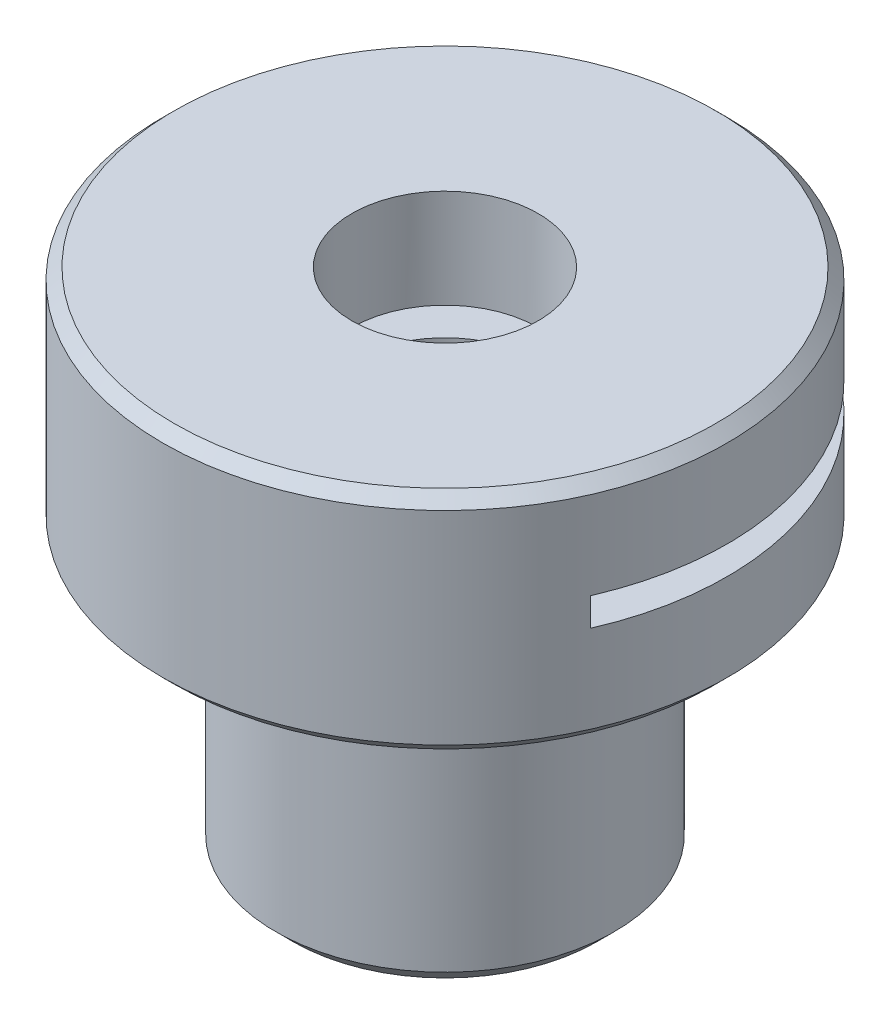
ISO-10303-21;
HEADER;
FILE_DESCRIPTION(('STEP AP214'),'2;1');
FILE_NAME('part.step','',(''),(''),'','','');
FILE_SCHEMA(('AUTOMOTIVE_DESIGN { 1 0 10303 214 1 1 1 1 }'));
ENDSEC;
DATA;
#1=APPLICATION_CONTEXT('core data for automotive mechanical design processes');
#2=APPLICATION_PROTOCOL_DEFINITION('international standard','automotive_design',2000,#1);
#3=PRODUCT_CONTEXT('',#1,'mechanical');
#4=PRODUCT('Part','Part','',(#3));
#5=PRODUCT_RELATED_PRODUCT_CATEGORY('part','',(#4));
#6=PRODUCT_DEFINITION_FORMATION('','',#4);
#7=PRODUCT_DEFINITION_CONTEXT('part definition',#1,'design');
#8=PRODUCT_DEFINITION('design','',#6,#7);
#9=PRODUCT_DEFINITION_SHAPE('','',#8);
#10=(LENGTH_UNIT() NAMED_UNIT(*) SI_UNIT(.MILLI.,.METRE.));
#11=(NAMED_UNIT(*) PLANE_ANGLE_UNIT() SI_UNIT($,.RADIAN.));
#12=(NAMED_UNIT(*) SI_UNIT($,.STERADIAN.) SOLID_ANGLE_UNIT());
#13=UNCERTAINTY_MEASURE_WITH_UNIT(LENGTH_MEASURE(1.E-05),#10,'distance_accuracy_value','');
#14=(GEOMETRIC_REPRESENTATION_CONTEXT(3) GLOBAL_UNCERTAINTY_ASSIGNED_CONTEXT((#13)) GLOBAL_UNIT_ASSIGNED_CONTEXT((#10,
#11,#12)) REPRESENTATION_CONTEXT('',''));
#15=CARTESIAN_POINT('',(0.,0.,0.));
#16=DIRECTION('',(0.,0.,1.));
#17=DIRECTION('',(1.,0.,0.));
#18=AXIS2_PLACEMENT_3D('',#15,#16,#17);
#19=CARTESIAN_POINT('',(0.,4.,0.));
#20=DIRECTION('',(0.,-1.,0.));
#21=DIRECTION('',(0.,0.,-1.));
#22=AXIS2_PLACEMENT_3D('',#19,#20,#21);
#23=CYLINDRICAL_SURFACE('',#22,5.);
#24=CARTESIAN_POINT('',(0.,0.199999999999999,0.));
#25=DIRECTION('',(0.,1.,0.));
#26=DIRECTION('',(0.,0.,1.));
#27=AXIS2_PLACEMENT_3D('',#24,#25,#26);
#28=CIRCLE('',#27,5.);
#29=CARTESIAN_POINT('',(0.,0.199999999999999,5.));
#30=VERTEX_POINT('',#29);
#31=EDGE_CURVE('E199',#30,#30,#28,.T.);
#32=ORIENTED_EDGE('',*,*,#31,.T.);
#33=EDGE_LOOP('',(#32));
#34=FACE_BOUND('',#33,.T.);
#35=CARTESIAN_POINT('',(0.,3.8,0.));
#36=DIRECTION('',(0.,1.,0.));
#37=DIRECTION('',(0.,0.,1.));
#38=AXIS2_PLACEMENT_3D('',#35,#36,#37);
#39=CIRCLE('',#38,5.);
#40=CARTESIAN_POINT('',(0.,3.8,5.));
#41=VERTEX_POINT('',#40);
#42=EDGE_CURVE('E203',#41,#41,#39,.F.);
#43=ORIENTED_EDGE('',*,*,#42,.T.);
#44=EDGE_LOOP('',(#43));
#45=FACE_BOUND('',#44,.T.);
#46=CARTESIAN_POINT('',(0.,1.75,0.));
#47=DIRECTION('',(0.,1.,0.));
#48=DIRECTION('',(-1.,0.,0.));
#49=AXIS2_PLACEMENT_3D('',#46,#47,#48);
#50=CIRCLE('',#49,5.);
#51=CARTESIAN_POINT('',(-1.22474487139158,1.75,-4.84767985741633));
#52=VERTEX_POINT('',#51);
#53=CARTESIAN_POINT('',(-4.58257569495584,1.75,2.));
#54=VERTEX_POINT('',#53);
#55=EDGE_CURVE('E207',#52,#54,#50,.T.);
#56=ORIENTED_EDGE('',*,*,#55,.F.);
#57=CARTESIAN_POINT('',(0.,3.24999999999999,-5.));
#58=CARTESIAN_POINT('',(-0.0690634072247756,3.24999806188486,-4.99999883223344));
#59=CARTESIAN_POINT('',(-0.138148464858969,3.24425704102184,-4.99855481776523));
#60=CARTESIAN_POINT('',(-0.274338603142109,3.22147904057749,-4.99293428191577));
#61=CARTESIAN_POINT('',(-0.341442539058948,3.20443565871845,-4.98875621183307));
#62=CARTESIAN_POINT('',(-0.471684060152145,3.15963395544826,-4.97813021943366));
#63=CARTESIAN_POINT('',(-0.534826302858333,3.1318885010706,-4.97168502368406));
#64=CARTESIAN_POINT('',(-0.655560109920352,3.06651550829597,-4.95721119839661));
#65=CARTESIAN_POINT('',(-0.713151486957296,3.02888763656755,-4.94918251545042));
#66=CARTESIAN_POINT('',(-0.822334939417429,2.94399934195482,-4.93222844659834));
#67=CARTESIAN_POINT('',(-0.873796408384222,2.89657368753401,-4.92328922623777));
#68=CARTESIAN_POINT('',(-0.968124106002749,2.79378982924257,-4.90561350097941));
#69=CARTESIAN_POINT('',(-1.01098936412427,2.73843073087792,-4.89687701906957));
#70=CARTESIAN_POINT('',(-1.08752211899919,2.62033731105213,-4.88045646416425));
#71=CARTESIAN_POINT('',(-1.12104351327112,2.55750564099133,-4.87278995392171));
#72=CARTESIAN_POINT('',(-1.1769974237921,2.42687632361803,-4.85957912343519));
#73=CARTESIAN_POINT('',(-1.1994317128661,2.35907947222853,-4.85403446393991));
#74=CARTESIAN_POINT('',(-1.23212903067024,2.2218804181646,-4.84583730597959));
#75=CARTESIAN_POINT('',(-1.24262689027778,2.15253758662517,-4.84312909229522));
#76=CARTESIAN_POINT('',(-1.25188481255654,2.01302619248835,-4.84074468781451));
#77=CARTESIAN_POINT('',(-1.25064678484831,1.94285776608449,-4.8410680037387));
#78=CARTESIAN_POINT('',(-1.23665543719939,1.8054868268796,-4.84466004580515));
#79=CARTESIAN_POINT('',(-1.22418195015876,1.73825364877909,-4.84785719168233));
#80=CARTESIAN_POINT('',(-1.18852015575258,1.60686579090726,-4.85672258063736));
#81=CARTESIAN_POINT('',(-1.16533108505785,1.54271133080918,-4.8623909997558));
#82=CARTESIAN_POINT('',(-1.10865789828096,1.41855165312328,-4.87562594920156));
#83=CARTESIAN_POINT('',(-1.07507222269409,1.35859485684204,-4.88321106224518));
#84=CARTESIAN_POINT('',(-0.998630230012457,1.24506774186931,-4.89941425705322));
#85=CARTESIAN_POINT('',(-0.955772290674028,1.19149854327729,-4.90803251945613));
#86=CARTESIAN_POINT('',(-0.86055285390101,1.090663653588,-4.92563233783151));
#87=CARTESIAN_POINT('',(-0.807955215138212,1.04362125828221,-4.93461724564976));
#88=CARTESIAN_POINT('',(-0.695509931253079,0.958982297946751,-4.95171637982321));
#89=CARTESIAN_POINT('',(-0.635662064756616,0.921386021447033,-4.95983057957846));
#90=CARTESIAN_POINT('',(-0.510096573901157,0.856624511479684,-4.97431443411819));
#91=CARTESIAN_POINT('',(-0.444359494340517,0.829495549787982,-4.98067800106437));
#92=CARTESIAN_POINT('',(-0.309063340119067,0.786735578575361,-4.99089930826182));
#93=CARTESIAN_POINT('',(-0.239504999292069,0.771102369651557,-4.99475752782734));
#94=CARTESIAN_POINT('',(-0.100449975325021,0.752118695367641,-4.99946249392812));
#95=CARTESIAN_POINT('',(-0.0309972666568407,0.748464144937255,-5.00038377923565));
#96=CARTESIAN_POINT('',(0.107527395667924,0.752707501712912,-4.99932337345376));
#97=CARTESIAN_POINT('',(0.176599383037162,0.760604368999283,-4.99734194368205));
#98=CARTESIAN_POINT('',(0.311345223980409,0.787475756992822,-4.99074650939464));
#99=CARTESIAN_POINT('',(0.377054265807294,0.806284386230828,-4.98617195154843));
#100=CARTESIAN_POINT('',(0.504381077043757,0.854255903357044,-4.97490588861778));
#101=CARTESIAN_POINT('',(0.565998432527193,0.883419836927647,-4.9682141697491));
#102=CARTESIAN_POINT('',(0.68460261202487,0.951863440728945,-4.95327756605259));
#103=CARTESIAN_POINT('',(0.741487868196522,0.991313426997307,-4.94500722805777));
#104=CARTESIAN_POINT('',(0.847938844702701,1.07899159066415,-4.92787090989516));
#105=CARTESIAN_POINT('',(0.897503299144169,1.12722128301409,-4.91900482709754));
#106=CARTESIAN_POINT('',(0.989158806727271,1.23250163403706,-4.90140797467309));
#107=CARTESIAN_POINT('',(1.03103655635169,1.28973975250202,-4.89268586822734));
#108=CARTESIAN_POINT('',(1.10459229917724,1.41061052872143,-4.87660731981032));
#109=CARTESIAN_POINT('',(1.13627074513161,1.47424290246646,-4.86925081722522));
#110=CARTESIAN_POINT('',(1.18829285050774,1.60575476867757,-4.85681745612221));
#111=CARTESIAN_POINT('',(1.20870366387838,1.67360635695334,-4.85172712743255));
#112=CARTESIAN_POINT('',(1.23778804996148,1.81192469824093,-4.84438953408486));
#113=CARTESIAN_POINT('',(1.24646418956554,1.88239087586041,-4.84214164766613));
#114=CARTESIAN_POINT('',(1.25169882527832,2.02176751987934,-4.84079084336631));
#115=CARTESIAN_POINT('',(1.24859824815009,2.09066452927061,-4.8415994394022));
#116=CARTESIAN_POINT('',(1.23114773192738,2.22691990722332,-4.84606590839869));
#117=CARTESIAN_POINT('',(1.21679801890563,2.29427830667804,-4.84972372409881));
#118=CARTESIAN_POINT('',(1.17744276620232,2.42517371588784,-4.85942717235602));
#119=CARTESIAN_POINT('',(1.15250117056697,2.48873108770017,-4.86545846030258));
#120=CARTESIAN_POINT('',(1.09272076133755,2.61080448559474,-4.87923129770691));
#121=CARTESIAN_POINT('',(1.05788057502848,2.66931981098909,-4.88697308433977));
#122=CARTESIAN_POINT('',(0.978223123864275,2.78129552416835,-4.90354695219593));
#123=CARTESIAN_POINT('',(0.933169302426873,2.8345842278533,-4.91240220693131));
#124=CARTESIAN_POINT('',(0.834824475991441,2.93295587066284,-4.93006689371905));
#125=CARTESIAN_POINT('',(0.781531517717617,2.97803685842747,-4.93887631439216));
#126=CARTESIAN_POINT('',(0.667056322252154,3.05950942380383,-4.95564713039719));
#127=CARTESIAN_POINT('',(0.605748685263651,3.09572884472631,-4.9635902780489));
#128=CARTESIAN_POINT('',(0.477721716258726,3.15728955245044,-4.97754104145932));
#129=CARTESIAN_POINT('',(0.411006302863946,3.18263863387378,-4.98355004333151));
#130=CARTESIAN_POINT('',(0.287008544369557,3.21797652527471,-4.99206716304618));
#131=CARTESIAN_POINT('',(0.230316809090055,3.22995936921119,-4.99502154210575));
#132=CARTESIAN_POINT('',(0.115755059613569,3.24597161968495,-4.9989883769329));
#133=CARTESIAN_POINT('',(0.0578851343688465,3.25000162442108,-5.00000097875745));
#134=CARTESIAN_POINT('',(0.,3.24999999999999,-5.));
#135=B_SPLINE_CURVE_WITH_KNOTS('',3,(#57,#58,#59,#60,#61,#62,#63,#64,#65,#66,#67,#68,#69,#70,
#71,#72,#73,#74,#75,#76,#77,#78,#79,#80,#81,#82,#83,#84,#85,#86,#87,#88,#89,#90,#91,#92,#93,#94,
#95,#96,#97,#98,#99,#100,#101,#102,#103,#104,#105,#106,#107,#108,#109,#110,#111,#112,#113,#114,
#115,#116,#117,#118,#119,#120,#121,#122,#123,#124,#125,#126,#127,#128,#129,#130,#131,#132,#133,
#134),.UNSPECIFIED.,.T.,.F.,(4,2,2,2,2,2,2,2,2,2,2,2,2,2,2,2,2,2,2,2,2,2,2,2,2,2,2,2,2,2,2,2,2,
2,2,2,2,2,4),(0.,0.206978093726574,0.414073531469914,0.620920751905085,0.827774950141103,
1.03845362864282,1.24915607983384,1.46298872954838,1.6767871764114,1.88630245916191,
2.09578365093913,2.30018747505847,2.50460586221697,2.71108773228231,2.91760575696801,
3.13001250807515,3.34242574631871,3.55556857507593,3.768670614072,3.97631924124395,
4.1839491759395,4.38850228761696,4.59307606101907,4.80127989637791,5.00951969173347,
5.22287091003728,5.43621265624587,5.64826878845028,5.86027852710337,6.06619816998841,
6.27211367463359,6.47680333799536,6.68152140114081,6.89157980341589,7.10168808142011,
7.31560154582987,7.52936136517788,7.70285202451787,7.87632963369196),.UNSPECIFIED.);
#136=CARTESIAN_POINT('',(1.22474487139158,1.75,-4.84767985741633));
#137=VERTEX_POINT('',#136);
#138=EDGE_CURVE('E128',#52,#137,#135,.T.);
#139=ORIENTED_EDGE('',*,*,#138,.T.);
#140=CARTESIAN_POINT('',(4.58257569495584,1.75,2.));
#141=VERTEX_POINT('',#140);
#142=EDGE_CURVE('E214',#141,#137,#50,.T.);
#143=ORIENTED_EDGE('',*,*,#142,.F.);
#144=DIRECTION('',(0.,-1.,0.));
#145=VECTOR('',#144,1.);
#146=CARTESIAN_POINT('',(4.58257569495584,4.,2.));
#147=LINE('',#146,#145);
#148=CARTESIAN_POINT('',(4.58257569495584,2.25,2.));
#149=VERTEX_POINT('',#148);
#150=EDGE_CURVE('E231',#141,#149,#147,.F.);
#151=ORIENTED_EDGE('',*,*,#150,.T.);
#152=CARTESIAN_POINT('',(0.,2.25,0.));
#153=DIRECTION('',(0.,-1.,0.));
#154=DIRECTION('',(0.,0.,-1.));
#155=AXIS2_PLACEMENT_3D('',#152,#153,#154);
#156=CIRCLE('',#155,5.);
#157=CARTESIAN_POINT('',(1.22474487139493,2.24999999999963,-4.84767985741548));
#158=VERTEX_POINT('',#157);
#159=EDGE_CURVE('E217',#158,#149,#156,.T.);
#160=ORIENTED_EDGE('',*,*,#159,.F.);
#161=CARTESIAN_POINT('',(-1.22474487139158,2.25,-4.84767985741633));
#162=VERTEX_POINT('',#161);
#163=EDGE_CURVE('E121',#158,#162,#135,.T.);
#164=ORIENTED_EDGE('',*,*,#163,.T.);
#165=CARTESIAN_POINT('',(-4.58257569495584,2.25,2.));
#166=VERTEX_POINT('',#165);
#167=EDGE_CURVE('E113',#166,#162,#156,.T.);
#168=ORIENTED_EDGE('',*,*,#167,.F.);
#169=DIRECTION('',(0.,-1.,0.));
#170=VECTOR('',#169,1.);
#171=CARTESIAN_POINT('',(-4.58257569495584,4.,2.));
#172=LINE('',#171,#170);
#173=EDGE_CURVE('E210',#166,#54,#172,.T.);
#174=ORIENTED_EDGE('',*,*,#173,.T.);
#175=EDGE_LOOP('',(#56,#139,#143,#151,#160,#164,#168,#174));
#176=FACE_BOUND('',#175,.T.);
#177=ADVANCED_FACE('F43',(#34,#45,#176),#23,.T.);
#178=CARTESIAN_POINT('',(0.,4.,0.));
#179=DIRECTION('',(0.,1.,0.));
#180=DIRECTION('',(0.,0.,1.));
#181=AXIS2_PLACEMENT_3D('',#178,#179,#180);
#182=CYLINDRICAL_SURFACE('',#181,1.64999999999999);
#183=CARTESIAN_POINT('',(0.,-5.,0.));
#184=DIRECTION('',(0.,1.,0.));
#185=DIRECTION('',(0.,0.,1.));
#186=AXIS2_PLACEMENT_3D('',#183,#184,#185);
#187=CIRCLE('',#186,1.65);
#188=CARTESIAN_POINT('',(0.,-5.,1.65));
#189=VERTEX_POINT('',#188);
#190=EDGE_CURVE('E222',#189,#189,#187,.T.);
#191=ORIENTED_EDGE('',*,*,#190,.F.);
#192=EDGE_LOOP('',(#191));
#193=FACE_BOUND('',#192,.T.);
#194=CARTESIAN_POINT('',(0.,1.75,0.));
#195=DIRECTION('',(0.,1.,0.));
#196=DIRECTION('',(-1.,0.,0.));
#197=AXIS2_PLACEMENT_3D('',#194,#195,#196);
#198=CIRCLE('',#197,1.64999999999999);
#199=CARTESIAN_POINT('',(-1.64999999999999,1.75,0.));
#200=VERTEX_POINT('',#199);
#201=EDGE_CURVE('E228',#200,#200,#198,.F.);
#202=ORIENTED_EDGE('',*,*,#201,.F.);
#203=EDGE_LOOP('',(#202));
#204=FACE_BOUND('',#203,.T.);
#205=ADVANCED_FACE('F169',(#193,#204),#182,.F.);
#206=CARTESIAN_POINT('',(0.,4.,0.));
#207=DIRECTION('',(0.,1.,0.));
#208=DIRECTION('',(0.,0.,1.));
#209=AXIS2_PLACEMENT_3D('',#206,#207,#208);
#210=CIRCLE('',#209,1.64999999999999);
#211=CARTESIAN_POINT('',(0.,4.,1.64999999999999));
#212=VERTEX_POINT('',#211);
#213=EDGE_CURVE('E216',#212,#212,#210,.T.);
#214=ORIENTED_EDGE('',*,*,#213,.T.);
#215=EDGE_LOOP('',(#214));
#216=FACE_BOUND('',#215,.T.);
#217=CARTESIAN_POINT('',(0.,2.25,0.));
#218=DIRECTION('',(0.,-1.,0.));
#219=DIRECTION('',(0.,0.,-1.));
#220=AXIS2_PLACEMENT_3D('',#217,#218,#219);
#221=CIRCLE('',#220,1.64999999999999);
#222=CARTESIAN_POINT('',(0.,2.25,-1.64999999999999));
#223=VERTEX_POINT('',#222);
#224=EDGE_CURVE('E225',#223,#223,#221,.F.);
#225=ORIENTED_EDGE('',*,*,#224,.F.);
#226=EDGE_LOOP('',(#225));
#227=FACE_BOUND('',#226,.T.);
#228=ADVANCED_FACE('F172',(#216,#227),#182,.F.);
#229=CARTESIAN_POINT('',(0.,4.,0.));
#230=DIRECTION('',(0.,1.,0.));
#231=DIRECTION('',(0.,0.,1.));
#232=AXIS2_PLACEMENT_3D('',#229,#230,#231);
#233=PLANE('',#232);
#234=CARTESIAN_POINT('',(0.,4.,0.));
#235=DIRECTION('',(0.,1.,0.));
#236=DIRECTION('',(0.,0.,1.));
#237=AXIS2_PLACEMENT_3D('',#234,#235,#236);
#238=CIRCLE('',#237,4.8);
#239=CARTESIAN_POINT('',(0.,4.,4.8));
#240=VERTEX_POINT('',#239);
#241=EDGE_CURVE('E101',#240,#240,#238,.T.);
#242=ORIENTED_EDGE('',*,*,#241,.T.);
#243=EDGE_LOOP('',(#242));
#244=FACE_BOUND('',#243,.T.);
#245=ORIENTED_EDGE('',*,*,#213,.F.);
#246=EDGE_LOOP('',(#245));
#247=FACE_BOUND('',#246,.T.);
#248=ADVANCED_FACE('F183',(#244,#247),#233,.T.);
#249=CARTESIAN_POINT('',(0.,0.,0.));
#250=DIRECTION('',(0.,1.,0.));
#251=DIRECTION('',(0.,0.,1.));
#252=AXIS2_PLACEMENT_3D('',#249,#250,#251);
#253=PLANE('',#252);
#254=CARTESIAN_POINT('',(0.,0.,0.));
#255=DIRECTION('',(0.,1.,0.));
#256=DIRECTION('',(0.,0.,1.));
#257=AXIS2_PLACEMENT_3D('',#254,#255,#256);
#258=CIRCLE('',#257,4.8);
#259=CARTESIAN_POINT('',(0.,0.,4.8));
#260=VERTEX_POINT('',#259);
#261=EDGE_CURVE('E237',#260,#260,#258,.F.);
#262=ORIENTED_EDGE('',*,*,#261,.T.);
#263=EDGE_LOOP('',(#262));
#264=FACE_BOUND('',#263,.T.);
#265=CARTESIAN_POINT('',(0.,0.,0.));
#266=DIRECTION('',(0.,-1.,0.));
#267=DIRECTION('',(0.,0.,-1.));
#268=AXIS2_PLACEMENT_3D('',#265,#266,#267);
#269=CIRCLE('',#268,2.5);
#270=CARTESIAN_POINT('',(0.,0.,-2.5));
#271=VERTEX_POINT('',#270);
#272=EDGE_CURVE('E446',#271,#271,#269,.T.);
#273=ORIENTED_EDGE('',*,*,#272,.F.);
#274=EDGE_LOOP('',(#273));
#275=FACE_BOUND('',#274,.T.);
#276=ADVANCED_FACE('F181',(#264,#275),#253,.F.);
#277=CARTESIAN_POINT('',(0.,-5.,0.));
#278=DIRECTION('',(0.,1.,0.));
#279=DIRECTION('',(0.,0.,1.));
#280=AXIS2_PLACEMENT_3D('',#277,#278,#279);
#281=CYLINDRICAL_SURFACE('',#280,3.);
#282=CARTESIAN_POINT('',(0.,-4.7,0.));
#283=DIRECTION('',(0.,-1.,0.));
#284=DIRECTION('',(0.,0.,-1.));
#285=AXIS2_PLACEMENT_3D('',#282,#283,#284);
#286=CIRCLE('',#285,3.);
#287=CARTESIAN_POINT('',(0.,-4.7,-3.));
#288=VERTEX_POINT('',#287);
#289=EDGE_CURVE('E11',#288,#288,#286,.F.);
#290=ORIENTED_EDGE('',*,*,#289,.T.);
#291=EDGE_LOOP('',(#290));
#292=FACE_BOUND('',#291,.T.);
#293=CARTESIAN_POINT('',(0.,-0.6,0.));
#294=DIRECTION('',(0.,-1.,0.));
#295=DIRECTION('',(0.,0.,-1.));
#296=AXIS2_PLACEMENT_3D('',#293,#294,#295);
#297=CIRCLE('',#296,3.);
#298=CARTESIAN_POINT('',(0.,-0.6,-3.));
#299=VERTEX_POINT('',#298);
#300=EDGE_CURVE('E129',#299,#299,#297,.T.);
#301=ORIENTED_EDGE('',*,*,#300,.T.);
#302=EDGE_LOOP('',(#301));
#303=FACE_BOUND('',#302,.T.);
#304=ADVANCED_FACE('F177',(#292,#303),#281,.T.);
#305=CARTESIAN_POINT('',(0.,-5.,0.));
#306=DIRECTION('',(0.,-1.,0.));
#307=DIRECTION('',(0.,0.,-1.));
#308=AXIS2_PLACEMENT_3D('',#305,#306,#307);
#309=PLANE('',#308);
#310=CARTESIAN_POINT('',(0.,-5.,0.));
#311=DIRECTION('',(0.,-1.,0.));
#312=DIRECTION('',(0.,0.,-1.));
#313=AXIS2_PLACEMENT_3D('',#310,#311,#312);
#314=CIRCLE('',#313,2.7);
#315=CARTESIAN_POINT('',(0.,-5.,-2.7));
#316=VERTEX_POINT('',#315);
#317=EDGE_CURVE('E52',#316,#316,#314,.T.);
#318=ORIENTED_EDGE('',*,*,#317,.T.);
#319=EDGE_LOOP('',(#318));
#320=FACE_BOUND('',#319,.T.);
#321=ORIENTED_EDGE('',*,*,#190,.T.);
#322=EDGE_LOOP('',(#321));
#323=FACE_BOUND('',#322,.T.);
#324=ADVANCED_FACE('F174',(#320,#323),#309,.T.);
#325=CARTESIAN_POINT('',(0.,0.,2.));
#326=DIRECTION('',(0.,0.,1.));
#327=DIRECTION('',(1.,0.,0.));
#328=AXIS2_PLACEMENT_3D('',#325,#326,#327);
#329=PLANE('',#328);
#330=DIRECTION('',(-1.,0.,0.));
#331=VECTOR('',#330,1.);
#332=CARTESIAN_POINT('',(-5.,2.25,2.));
#333=LINE('',#332,#331);
#334=EDGE_CURVE('E458',#149,#166,#333,.T.);
#335=ORIENTED_EDGE('',*,*,#334,.F.);
#336=ORIENTED_EDGE('',*,*,#150,.F.);
#337=DIRECTION('',(1.,0.,0.));
#338=VECTOR('',#337,1.);
#339=CARTESIAN_POINT('',(-5.,1.75,2.));
#340=LINE('',#339,#338);
#341=EDGE_CURVE('E160',#54,#141,#340,.T.);
#342=ORIENTED_EDGE('',*,*,#341,.F.);
#343=ORIENTED_EDGE('',*,*,#173,.F.);
#344=EDGE_LOOP('',(#335,#336,#342,#343));
#345=FACE_BOUND('',#344,.T.);
#346=ADVANCED_FACE('F145',(#345),#329,.F.);
#347=CARTESIAN_POINT('',(-5.,1.75,2.));
#348=DIRECTION('',(0.,1.,0.));
#349=DIRECTION('',(-1.,0.,0.));
#350=AXIS2_PLACEMENT_3D('',#347,#348,#349);
#351=PLANE('',#350);
#352=DIRECTION('',(0.,0.,-1.));
#353=VECTOR('',#352,1.);
#354=CARTESIAN_POINT('',(1.22474487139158,1.75,-5.));
#355=LINE('',#354,#353);
#356=CARTESIAN_POINT('',(1.22474487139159,1.75,-2.5));
#357=VERTEX_POINT('',#356);
#358=EDGE_CURVE('E116',#357,#137,#355,.T.);
#359=ORIENTED_EDGE('',*,*,#358,.F.);
#360=CARTESIAN_POINT('',(-6.35792181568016,1.75,-5.57210123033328));
#361=CARTESIAN_POINT('',(-6.13859290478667,1.75,-5.440417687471));
#362=CARTESIAN_POINT('',(-5.91926002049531,1.75,-5.30874076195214));
#363=CARTESIAN_POINT('',(-5.48058070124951,1.75,-5.04540835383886));
#364=CARTESIAN_POINT('',(-5.26123426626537,1.75,-4.91375287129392));
#365=CARTESIAN_POINT('',(-4.82250859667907,1.75,-4.65046336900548));
#366=CARTESIAN_POINT('',(-4.60312936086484,1.75,-4.51882935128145));
#367=CARTESIAN_POINT('',(-4.16434356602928,1.75,-4.25560797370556));
#368=CARTESIAN_POINT('',(-3.94493700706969,1.75,-4.12402061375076));
#369=CARTESIAN_POINT('',(-3.50249292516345,1.75,-3.85876888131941));
#370=CARTESIAN_POINT('',(-3.27945467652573,1.75,-3.7251057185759));
#371=CARTESIAN_POINT('',(-2.83329290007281,1.75,-3.45791858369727));
#372=CARTESIAN_POINT('',(-2.61016937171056,1.75,-3.32439461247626));
#373=CARTESIAN_POINT('',(-2.1637738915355,1.75,-3.05761825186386));
#374=CARTESIAN_POINT('',(-1.94050194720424,1.75,-2.9243658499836));
#375=CARTESIAN_POINT('',(-1.60526329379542,1.75,-2.72504620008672));
#376=CARTESIAN_POINT('',(-1.49346255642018,1.75,-2.65869983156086));
#377=CARTESIAN_POINT('',(-1.26965300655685,1.75,-2.52635920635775));
#378=CARTESIAN_POINT('',(-1.15764419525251,1.75,-2.46036494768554));
#379=CARTESIAN_POINT('',(-1.0018011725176,1.75,-2.36929891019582));
#380=CARTESIAN_POINT('',(-0.95816782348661,1.75,-2.34388384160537));
#381=CARTESIAN_POINT('',(-0.870791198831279,1.75,-2.29323993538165));
#382=CARTESIAN_POINT('',(-0.827047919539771,1.75,-2.26801110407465));
#383=CARTESIAN_POINT('',(-0.739501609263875,1.75,-2.21789731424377));
#384=CARTESIAN_POINT('',(-0.695698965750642,1.75,-2.19301168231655));
#385=CARTESIAN_POINT('',(-0.607830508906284,1.75,-2.14371848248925));
#386=CARTESIAN_POINT('',(-0.56376471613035,1.75,-2.1193108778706));
#387=CARTESIAN_POINT('',(-0.47210947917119,1.75,-2.06966597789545));
#388=CARTESIAN_POINT('',(-0.424487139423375,1.75,-2.04448807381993));
#389=CARTESIAN_POINT('',(-0.352108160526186,1.75,-2.00827488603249));
#390=CARTESIAN_POINT('',(-0.327758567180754,1.75,-1.99643351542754));
#391=CARTESIAN_POINT('',(-0.278639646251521,1.75,-1.97366187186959));
#392=CARTESIAN_POINT('',(-0.253870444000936,1.75,-1.96273133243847));
#393=CARTESIAN_POINT('',(-0.199563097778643,1.75,-1.94068215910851));
#394=CARTESIAN_POINT('',(-0.169913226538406,1.75,-1.92983088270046));
#395=CARTESIAN_POINT('',(-0.109653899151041,1.75,-1.91222061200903));
#396=CARTESIAN_POINT('',(-0.0790600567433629,1.75,-1.90541446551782));
#397=CARTESIAN_POINT('',(-0.0347496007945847,1.75,-1.90037654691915));
#398=CARTESIAN_POINT('',(-0.0213421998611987,1.75,-1.89946918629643));
#399=CARTESIAN_POINT('',(0.00549459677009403,1.75,-1.89896044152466));
#400=CARTESIAN_POINT('',(0.0189239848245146,1.75,-1.89935867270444));
#401=CARTESIAN_POINT('',(0.0457922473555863,1.75,-1.90142614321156));
#402=CARTESIAN_POINT('',(0.0592302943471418,1.75,-1.90310579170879));
#403=CARTESIAN_POINT('',(0.0859167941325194,1.75,-1.90757569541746));
#404=CARTESIAN_POINT('',(0.0991652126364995,1.75,-1.91036614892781));
#405=CARTESIAN_POINT('',(0.136276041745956,1.75,-1.91949942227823));
#406=CARTESIAN_POINT('',(0.159880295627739,1.75,-1.92687392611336));
#407=CARTESIAN_POINT('',(0.206462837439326,1.75,-1.943414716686));
#408=CARTESIAN_POINT('',(0.229439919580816,1.75,-1.95258421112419));
#409=CARTESIAN_POINT('',(0.275033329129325,1.75,-1.97204165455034));
#410=CARTESIAN_POINT('',(0.297647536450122,1.75,-1.98233450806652));
#411=CARTESIAN_POINT('',(0.342554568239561,1.75,-2.00360317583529));
#412=CARTESIAN_POINT('',(0.364847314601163,1.75,-2.01457915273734));
#413=CARTESIAN_POINT('',(0.432412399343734,1.75,-2.04867036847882));
#414=CARTESIAN_POINT('',(0.477334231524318,1.75,-2.07247597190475));
#415=CARTESIAN_POINT('',(0.566568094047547,1.75,-2.12084936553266));
#416=CARTESIAN_POINT('',(0.610881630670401,1.75,-2.14541443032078));
#417=CARTESIAN_POINT('',(0.700107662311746,1.75,-2.19550223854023));
#418=CARTESIAN_POINT('',(0.745014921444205,1.75,-2.22103431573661));
#419=CARTESIAN_POINT('',(0.834661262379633,1.75,-2.27239083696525));
#420=CARTESIAN_POINT('',(0.879400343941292,1.75,-2.29821528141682));
#421=CARTESIAN_POINT('',(1.01346275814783,1.75,-2.37596784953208));
#422=CARTESIAN_POINT('',(1.10262582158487,1.75,-2.42817211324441));
#423=CARTESIAN_POINT('',(1.28088579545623,1.75,-2.53300667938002));
#424=CARTESIAN_POINT('',(1.36998239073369,1.75,-2.58563751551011));
#425=CARTESIAN_POINT('',(1.5480549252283,1.75,-2.69109751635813));
#426=CARTESIAN_POINT('',(1.63703086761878,1.75,-2.74392667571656));
#427=CARTESIAN_POINT('',(1.88558124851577,1.75,-2.89172678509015));
#428=CARTESIAN_POINT('',(2.04507735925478,1.75,-2.98682935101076));
#429=CARTESIAN_POINT('',(2.28411640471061,1.75,-3.12954632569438));
#430=CARTESIAN_POINT('',(2.36370025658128,1.75,-3.17709227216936));
#431=CARTESIAN_POINT('',(2.52284583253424,1.75,-3.27221954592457));
#432=CARTESIAN_POINT('',(2.60240755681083,1.75,-3.31980087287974));
#433=CARTESIAN_POINT('',(2.68196145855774,1.75,-3.36739528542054));
#434=B_SPLINE_CURVE_WITH_KNOTS('',3,(#360,#361,#362,#363,#364,#365,#366,#367,#368,#369,#370,
#371,#372,#373,#374,#375,#376,#377,#378,#379,#380,#381,#382,#383,#384,#385,#386,#387,#388,#389,
#390,#391,#392,#393,#394,#395,#396,#397,#398,#399,#400,#401,#402,#403,#404,#405,#406,#407,#408,
#409,#410,#411,#412,#413,#414,#415,#416,#417,#418,#419,#420,#421,#422,#423,#424,#425,#426,#427,
#428,#429,#430,#431,#432,#433),.UNSPECIFIED.,.F.,.F.,(4,2,2,2,2,2,2,2,2,2,2,2,2,2,2,2,2,2,2,2,2,
2,2,2,2,2,2,2,2,2,2,2,2,2,2,2,4),(0.,0.767470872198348,1.53494349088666,2.30246734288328,
3.06998949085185,3.85005808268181,4.63013176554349,5.4101687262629,5.80018300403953,
6.19019506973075,6.34168118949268,6.49317243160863,6.64430454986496,6.79542501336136,
6.95699866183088,7.03821641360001,7.11941031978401,7.21402042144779,7.30750489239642,
7.34775887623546,7.38800100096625,7.42857354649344,7.46915333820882,7.54320241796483,
7.61738505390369,7.69190560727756,7.76644397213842,7.91893783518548,8.07093661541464,
8.22590814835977,8.3808799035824,8.69084218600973,9.00128346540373,9.31171641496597,
9.86880819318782,10.1469230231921,10.4250353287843),.UNSPECIFIED.);
#435=CARTESIAN_POINT('',(-1.22474487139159,1.75,-2.5));
#436=VERTEX_POINT('',#435);
#437=EDGE_CURVE('E108',#436,#357,#434,.T.);
#438=ORIENTED_EDGE('',*,*,#437,.F.);
#439=DIRECTION('',(0.,0.,-1.));
#440=VECTOR('',#439,1.);
#441=CARTESIAN_POINT('',(-1.22474487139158,1.75,-5.));
#442=LINE('',#441,#440);
#443=EDGE_CURVE('E114',#52,#436,#442,.F.);
#444=ORIENTED_EDGE('',*,*,#443,.F.);
#445=ORIENTED_EDGE('',*,*,#55,.T.);
#446=ORIENTED_EDGE('',*,*,#341,.T.);
#447=ORIENTED_EDGE('',*,*,#142,.T.);
#448=EDGE_LOOP('',(#359,#438,#444,#445,#446,#447));
#449=FACE_BOUND('',#448,.T.);
#450=ORIENTED_EDGE('',*,*,#201,.T.);
#451=EDGE_LOOP('',(#450));
#452=FACE_BOUND('',#451,.T.);
#453=ADVANCED_FACE('F163',(#449,#452),#351,.T.);
#454=CARTESIAN_POINT('',(-5.,2.25,2.));
#455=DIRECTION('',(0.,-1.,0.));
#456=DIRECTION('',(0.,0.,-1.));
#457=AXIS2_PLACEMENT_3D('',#454,#455,#456);
#458=PLANE('',#457);
#459=DIRECTION('',(0.,0.,-1.));
#460=VECTOR('',#459,1.);
#461=CARTESIAN_POINT('',(-1.22474487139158,2.25,-5.));
#462=LINE('',#461,#460);
#463=CARTESIAN_POINT('',(-1.22474487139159,2.25,-2.5));
#464=VERTEX_POINT('',#463);
#465=EDGE_CURVE('E106',#464,#162,#462,.T.);
#466=ORIENTED_EDGE('',*,*,#465,.F.);
#467=CARTESIAN_POINT('',(-6.35792181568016,2.25,-5.57210123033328));
#468=CARTESIAN_POINT('',(-6.13859290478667,2.25,-5.440417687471));
#469=CARTESIAN_POINT('',(-5.91926002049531,2.25,-5.30874076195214));
#470=CARTESIAN_POINT('',(-5.48058070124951,2.25,-5.04540835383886));
#471=CARTESIAN_POINT('',(-5.26123426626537,2.25,-4.91375287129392));
#472=CARTESIAN_POINT('',(-4.82250859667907,2.25,-4.65046336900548));
#473=CARTESIAN_POINT('',(-4.60312936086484,2.25,-4.51882935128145));
#474=CARTESIAN_POINT('',(-4.16434356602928,2.25,-4.25560797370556));
#475=CARTESIAN_POINT('',(-3.94493700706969,2.25,-4.12402061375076));
#476=CARTESIAN_POINT('',(-3.50249292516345,2.25,-3.85876888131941));
#477=CARTESIAN_POINT('',(-3.27945467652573,2.25,-3.7251057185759));
#478=CARTESIAN_POINT('',(-2.83329290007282,2.25,-3.45791858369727));
#479=CARTESIAN_POINT('',(-2.61016937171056,2.25,-3.32439461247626));
#480=CARTESIAN_POINT('',(-2.16377389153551,2.25,-3.05761825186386));
#481=CARTESIAN_POINT('',(-1.94050194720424,2.25,-2.9243658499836));
#482=CARTESIAN_POINT('',(-1.60526329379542,2.25,-2.72504620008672));
#483=CARTESIAN_POINT('',(-1.49346255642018,2.25,-2.65869983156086));
#484=CARTESIAN_POINT('',(-1.26965300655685,2.25,-2.52635920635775));
#485=CARTESIAN_POINT('',(-1.15764419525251,2.25,-2.46036494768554));
#486=CARTESIAN_POINT('',(-1.0018011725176,2.25,-2.36929891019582));
#487=CARTESIAN_POINT('',(-0.95816782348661,2.25,-2.34388384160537));
#488=CARTESIAN_POINT('',(-0.870791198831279,2.25,-2.29323993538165));
#489=CARTESIAN_POINT('',(-0.827047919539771,2.25,-2.26801110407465));
#490=CARTESIAN_POINT('',(-0.739501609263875,2.25,-2.21789731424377));
#491=CARTESIAN_POINT('',(-0.695698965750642,2.25,-2.19301168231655));
#492=CARTESIAN_POINT('',(-0.607830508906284,2.25,-2.14371848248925));
#493=CARTESIAN_POINT('',(-0.56376471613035,2.25,-2.1193108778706));
#494=CARTESIAN_POINT('',(-0.47210947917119,2.25,-2.06966597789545));
#495=CARTESIAN_POINT('',(-0.424487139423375,2.25,-2.04448807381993));
#496=CARTESIAN_POINT('',(-0.352108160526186,2.25,-2.00827488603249));
#497=CARTESIAN_POINT('',(-0.327758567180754,2.25,-1.99643351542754));
#498=CARTESIAN_POINT('',(-0.278639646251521,2.25,-1.97366187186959));
#499=CARTESIAN_POINT('',(-0.253870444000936,2.25,-1.96273133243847));
#500=CARTESIAN_POINT('',(-0.199563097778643,2.25,-1.94068215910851));
#501=CARTESIAN_POINT('',(-0.169913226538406,2.25,-1.92983088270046));
#502=CARTESIAN_POINT('',(-0.109653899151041,2.25,-1.91222061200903));
#503=CARTESIAN_POINT('',(-0.0790600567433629,2.25,-1.90541446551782));
#504=CARTESIAN_POINT('',(-0.034749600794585,2.25,-1.90037654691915));
#505=CARTESIAN_POINT('',(-0.0213421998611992,2.25,-1.89946918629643));
#506=CARTESIAN_POINT('',(0.00549459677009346,2.25,-1.89896044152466));
#507=CARTESIAN_POINT('',(0.0189239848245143,2.25,-1.89935867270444));
#508=CARTESIAN_POINT('',(0.0457922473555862,2.25,-1.90142614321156));
#509=CARTESIAN_POINT('',(0.0592302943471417,2.25,-1.90310579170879));
#510=CARTESIAN_POINT('',(0.0859167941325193,2.25,-1.90757569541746));
#511=CARTESIAN_POINT('',(0.0991652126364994,2.25,-1.91036614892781));
#512=CARTESIAN_POINT('',(0.136276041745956,2.25,-1.91949942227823));
#513=CARTESIAN_POINT('',(0.159880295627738,2.25,-1.92687392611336));
#514=CARTESIAN_POINT('',(0.206462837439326,2.25,-1.943414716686));
#515=CARTESIAN_POINT('',(0.229439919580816,2.25,-1.95258421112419));
#516=CARTESIAN_POINT('',(0.275033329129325,2.25,-1.97204165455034));
#517=CARTESIAN_POINT('',(0.297647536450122,2.25,-1.98233450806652));
#518=CARTESIAN_POINT('',(0.342554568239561,2.25,-2.00360317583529));
#519=CARTESIAN_POINT('',(0.364847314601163,2.25,-2.01457915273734));
#520=CARTESIAN_POINT('',(0.432412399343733,2.25,-2.04867036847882));
#521=CARTESIAN_POINT('',(0.477334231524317,2.25,-2.07247597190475));
#522=CARTESIAN_POINT('',(0.566568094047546,2.25,-2.12084936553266));
#523=CARTESIAN_POINT('',(0.6108816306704,2.25,-2.14541443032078));
#524=CARTESIAN_POINT('',(0.700107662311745,2.25,-2.19550223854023));
#525=CARTESIAN_POINT('',(0.745014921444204,2.25,-2.22103431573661));
#526=CARTESIAN_POINT('',(0.834661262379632,2.25,-2.27239083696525));
#527=CARTESIAN_POINT('',(0.879400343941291,2.25,-2.29821528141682));
#528=CARTESIAN_POINT('',(1.01346275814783,2.25,-2.37596784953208));
#529=CARTESIAN_POINT('',(1.10262582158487,2.25,-2.4281721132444));
#530=CARTESIAN_POINT('',(1.28088579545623,2.25,-2.53300667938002));
#531=CARTESIAN_POINT('',(1.36998239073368,2.25,-2.58563751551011));
#532=CARTESIAN_POINT('',(1.5480549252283,2.25,-2.69109751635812));
#533=CARTESIAN_POINT('',(1.63703086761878,2.25,-2.74392667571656));
#534=CARTESIAN_POINT('',(1.88558124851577,2.25,-2.89172678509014));
#535=CARTESIAN_POINT('',(2.04507735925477,2.25,-2.98682935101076));
#536=CARTESIAN_POINT('',(2.28411640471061,2.25,-3.12954632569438));
#537=CARTESIAN_POINT('',(2.36370025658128,2.25,-3.17709227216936));
#538=CARTESIAN_POINT('',(2.52284583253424,2.25,-3.27221954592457));
#539=CARTESIAN_POINT('',(2.60240755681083,2.25,-3.31980087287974));
#540=CARTESIAN_POINT('',(2.68196145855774,2.25,-3.36739528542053));
#541=B_SPLINE_CURVE_WITH_KNOTS('',3,(#467,#468,#469,#470,#471,#472,#473,#474,#475,#476,#477,
#478,#479,#480,#481,#482,#483,#484,#485,#486,#487,#488,#489,#490,#491,#492,#493,#494,#495,#496,
#497,#498,#499,#500,#501,#502,#503,#504,#505,#506,#507,#508,#509,#510,#511,#512,#513,#514,#515,
#516,#517,#518,#519,#520,#521,#522,#523,#524,#525,#526,#527,#528,#529,#530,#531,#532,#533,#534,
#535,#536,#537,#538,#539,#540),.UNSPECIFIED.,.F.,.F.,(4,2,2,2,2,2,2,2,2,2,2,2,2,2,2,2,2,2,2,2,2,
2,2,2,2,2,2,2,2,2,2,2,2,2,2,2,4),(0.,0.767470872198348,1.53494349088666,2.30246734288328,
3.06998949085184,3.85005808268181,4.63013176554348,5.4101687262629,5.80018300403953,
6.19019506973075,6.34168118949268,6.49317243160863,6.64430454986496,6.79542501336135,
6.95699866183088,7.03821641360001,7.11941031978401,7.21402042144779,7.30750489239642,
7.34775887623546,7.38800100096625,7.42857354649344,7.46915333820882,7.54320241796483,
7.61738505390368,7.69190560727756,7.76644397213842,7.91893783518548,8.07093661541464,
8.22590814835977,8.3808799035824,8.69084218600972,9.00128346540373,9.31171641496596,
9.86880819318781,10.1469230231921,10.4250353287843),.UNSPECIFIED.);
#542=CARTESIAN_POINT('',(1.22474487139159,2.25,-2.5));
#543=VERTEX_POINT('',#542);
#544=EDGE_CURVE('E95',#543,#464,#541,.F.);
#545=ORIENTED_EDGE('',*,*,#544,.F.);
#546=DIRECTION('',(0.,0.,-1.));
#547=VECTOR('',#546,1.);
#548=CARTESIAN_POINT('',(1.22474487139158,2.25,-5.));
#549=LINE('',#548,#547);
#550=EDGE_CURVE('E100',#158,#543,#549,.F.);
#551=ORIENTED_EDGE('',*,*,#550,.F.);
#552=ORIENTED_EDGE('',*,*,#159,.T.);
#553=ORIENTED_EDGE('',*,*,#334,.T.);
#554=ORIENTED_EDGE('',*,*,#167,.T.);
#555=EDGE_LOOP('',(#466,#545,#551,#552,#553,#554));
#556=FACE_BOUND('',#555,.T.);
#557=ORIENTED_EDGE('',*,*,#224,.T.);
#558=EDGE_LOOP('',(#557));
#559=FACE_BOUND('',#558,.T.);
#560=ADVANCED_FACE('F110',(#556,#559),#458,.T.);
#561=CARTESIAN_POINT('',(0.,0.199999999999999,0.));
#562=DIRECTION('',(0.,1.,0.));
#563=DIRECTION('',(0.,0.,1.));
#564=AXIS2_PLACEMENT_3D('',#561,#562,#563);
#565=CONICAL_SURFACE('',#564,5.,0.785398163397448);
#566=ORIENTED_EDGE('',*,*,#261,.F.);
#567=EDGE_LOOP('',(#566));
#568=FACE_BOUND('',#567,.T.);
#569=ORIENTED_EDGE('',*,*,#31,.F.);
#570=EDGE_LOOP('',(#569));
#571=FACE_BOUND('',#570,.T.);
#572=ADVANCED_FACE('F243',(#568,#571),#565,.T.);
#573=CARTESIAN_POINT('',(0.,4.,0.));
#574=DIRECTION('',(0.,-1.,0.));
#575=DIRECTION('',(0.,0.,-1.));
#576=AXIS2_PLACEMENT_3D('',#573,#574,#575);
#577=CONICAL_SURFACE('',#576,4.8,0.785398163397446);
#578=ORIENTED_EDGE('',*,*,#42,.F.);
#579=EDGE_LOOP('',(#578));
#580=FACE_BOUND('',#579,.T.);
#581=ORIENTED_EDGE('',*,*,#241,.F.);
#582=EDGE_LOOP('',(#581));
#583=FACE_BOUND('',#582,.T.);
#584=ADVANCED_FACE('F143',(#580,#583),#577,.T.);
#585=CARTESIAN_POINT('',(0.,2.,-2.5));
#586=DIRECTION('',(0.,0.,-1.));
#587=DIRECTION('',(-1.,0.,0.));
#588=AXIS2_PLACEMENT_3D('',#585,#586,#587);
#589=CONICAL_SURFACE('',#588,1.25,1.02974425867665);
#590=ORIENTED_EDGE('',*,*,#544,.T.);
#591=CARTESIAN_POINT('',(0.,2.,-2.5));
#592=DIRECTION('',(0.,0.,-1.));
#593=DIRECTION('',(-1.,0.,0.));
#594=AXIS2_PLACEMENT_3D('',#591,#592,#593);
#595=CIRCLE('',#594,1.25);
#596=EDGE_CURVE('E65',#464,#543,#595,.T.);
#597=ORIENTED_EDGE('',*,*,#596,.T.);
#598=EDGE_LOOP('',(#590,#597));
#599=FACE_BOUND('',#598,.T.);
#600=ADVANCED_FACE('F96',(#599),#589,.F.);
#601=CARTESIAN_POINT('',(0.,2.,-5.));
#602=DIRECTION('',(0.,0.,-1.));
#603=DIRECTION('',(-1.,0.,0.));
#604=AXIS2_PLACEMENT_3D('',#601,#602,#603);
#605=CYLINDRICAL_SURFACE('',#604,1.24999999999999);
#606=ORIENTED_EDGE('',*,*,#465,.T.);
#607=ORIENTED_EDGE('',*,*,#163,.F.);
#608=ORIENTED_EDGE('',*,*,#550,.T.);
#609=ORIENTED_EDGE('',*,*,#596,.F.);
#610=EDGE_LOOP('',(#606,#607,#608,#609));
#611=FACE_BOUND('',#610,.T.);
#612=ADVANCED_FACE('F105',(#611),#605,.F.);
#613=ORIENTED_EDGE('',*,*,#358,.T.);
#614=ORIENTED_EDGE('',*,*,#138,.F.);
#615=ORIENTED_EDGE('',*,*,#443,.T.);
#616=EDGE_CURVE('E58',#357,#436,#595,.T.);
#617=ORIENTED_EDGE('',*,*,#616,.F.);
#618=EDGE_LOOP('',(#613,#614,#615,#617));
#619=FACE_BOUND('',#618,.T.);
#620=ADVANCED_FACE('F137',(#619),#605,.F.);
#621=ORIENTED_EDGE('',*,*,#437,.T.);
#622=ORIENTED_EDGE('',*,*,#616,.T.);
#623=EDGE_LOOP('',(#621,#622));
#624=FACE_BOUND('',#623,.T.);
#625=ADVANCED_FACE('F144',(#624),#589,.F.);
#626=CARTESIAN_POINT('',(0.,-0.6,0.));
#627=DIRECTION('',(0.,-1.,0.));
#628=DIRECTION('',(0.,0.,-1.));
#629=AXIS2_PLACEMENT_3D('',#626,#627,#628);
#630=PLANE('',#629);
#631=CARTESIAN_POINT('',(0.,-0.6,0.));
#632=DIRECTION('',(0.,-1.,0.));
#633=DIRECTION('',(0.,0.,-1.));
#634=AXIS2_PLACEMENT_3D('',#631,#632,#633);
#635=CIRCLE('',#634,2.5);
#636=CARTESIAN_POINT('',(0.,-0.6,-2.5));
#637=VERTEX_POINT('',#636);
#638=EDGE_CURVE('E444',#637,#637,#635,.T.);
#639=ORIENTED_EDGE('',*,*,#638,.T.);
#640=EDGE_LOOP('',(#639));
#641=FACE_BOUND('',#640,.T.);
#642=ORIENTED_EDGE('',*,*,#300,.F.);
#643=EDGE_LOOP('',(#642));
#644=FACE_BOUND('',#643,.T.);
#645=ADVANCED_FACE('F138',(#641,#644),#630,.F.);
#646=CARTESIAN_POINT('',(0.,-0.6,0.));
#647=DIRECTION('',(0.,1.,0.));
#648=DIRECTION('',(0.,0.,1.));
#649=AXIS2_PLACEMENT_3D('',#646,#647,#648);
#650=CYLINDRICAL_SURFACE('',#649,2.5);
#651=ORIENTED_EDGE('',*,*,#638,.F.);
#652=EDGE_LOOP('',(#651));
#653=FACE_BOUND('',#652,.T.);
#654=ORIENTED_EDGE('',*,*,#272,.T.);
#655=EDGE_LOOP('',(#654));
#656=FACE_BOUND('',#655,.T.);
#657=ADVANCED_FACE('F293',(#653,#656),#650,.T.);
#658=CARTESIAN_POINT('',(0.,-5.,0.));
#659=DIRECTION('',(0.,1.,0.));
#660=DIRECTION('',(0.,0.,1.));
#661=AXIS2_PLACEMENT_3D('',#658,#659,#660);
#662=CONICAL_SURFACE('',#661,2.7,0.785398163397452);
#663=ORIENTED_EDGE('',*,*,#289,.F.);
#664=EDGE_LOOP('',(#663));
#665=FACE_BOUND('',#664,.T.);
#666=ORIENTED_EDGE('',*,*,#317,.F.);
#667=EDGE_LOOP('',(#666));
#668=FACE_BOUND('',#667,.T.);
#669=ADVANCED_FACE('F46',(#665,#668),#662,.T.);
#670=CLOSED_SHELL('',(#177,#205,#228,#248,#276,#304,#324,#346,#453,#560,#572,#584,#600,#612,
#620,#625,#645,#657,#669));
#671=MANIFOLD_SOLID_BREP('B2',#670);
#672=ADVANCED_BREP_SHAPE_REPRESENTATION('',(#18,#671),#14);
#673=SHAPE_DEFINITION_REPRESENTATION(#9,#672);
ENDSEC;
END-ISO-10303-21;
